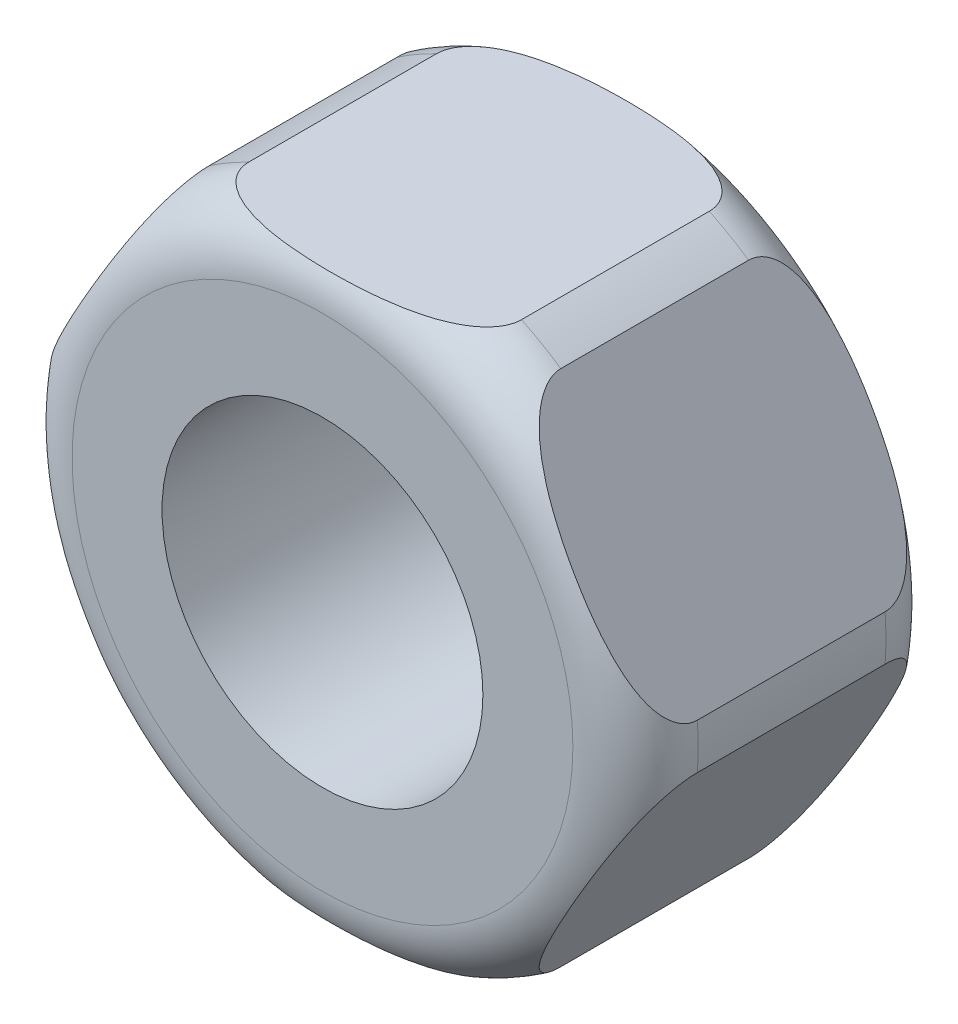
from build123d import *

# Parameters (mm, degrees)
ESQUISSE1_R             = 10
EXTRUSION1_DEPTH        = 10
CONG_1_R                = 2
ESQUISSE2_R             = 14.142135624
ENL_V_MAT_EXTRU_1_DEPTH = 18.320508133
ESQUISSE3_R             = 5.125
ENL_V_MAT_EXTRU_2_DEPTH = 17.763054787


with BuildPart() as part:
    # Esquisse1 → Extrusion1 (new body)
    with BuildSketch(Plane.XY):
        Circle(ESQUISSE1_R)
    extrude(amount=EXTRUSION1_DEPTH)

    # Cong_1
    cong_1_edges = [part.edges().sort_by_distance(p)[0] for p in [
        (-10, 0, 0),
        (-10, 0, 10),
    ]]
    fillet(cong_1_edges, radius=CONG_1_R)

    # Esquisse2 → Enl_v. mat.-Extru.1 (cut, through all)
    with BuildSketch(Plane.XY.offset(10)):
        Circle(ESQUISSE2_R)
        Polygon((10.392304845, 0), (5.196152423, 9), (-5.196152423, 9), (-10.392304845, 0), (-5.196152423, -9), (5.196152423, -9), align=None, mode=Mode.SUBTRACT)
    extrude(amount=-ENL_V_MAT_EXTRU_1_DEPTH, mode=Mode.SUBTRACT)

    # Esquisse3 → Enl_v. mat.-Extru.2 (cut, through all)
    with BuildSketch(Plane.XY.offset(10)):
        Circle(ESQUISSE3_R)
    extrude(amount=-ENL_V_MAT_EXTRU_2_DEPTH, mode=Mode.SUBTRACT)


solid = part.part
